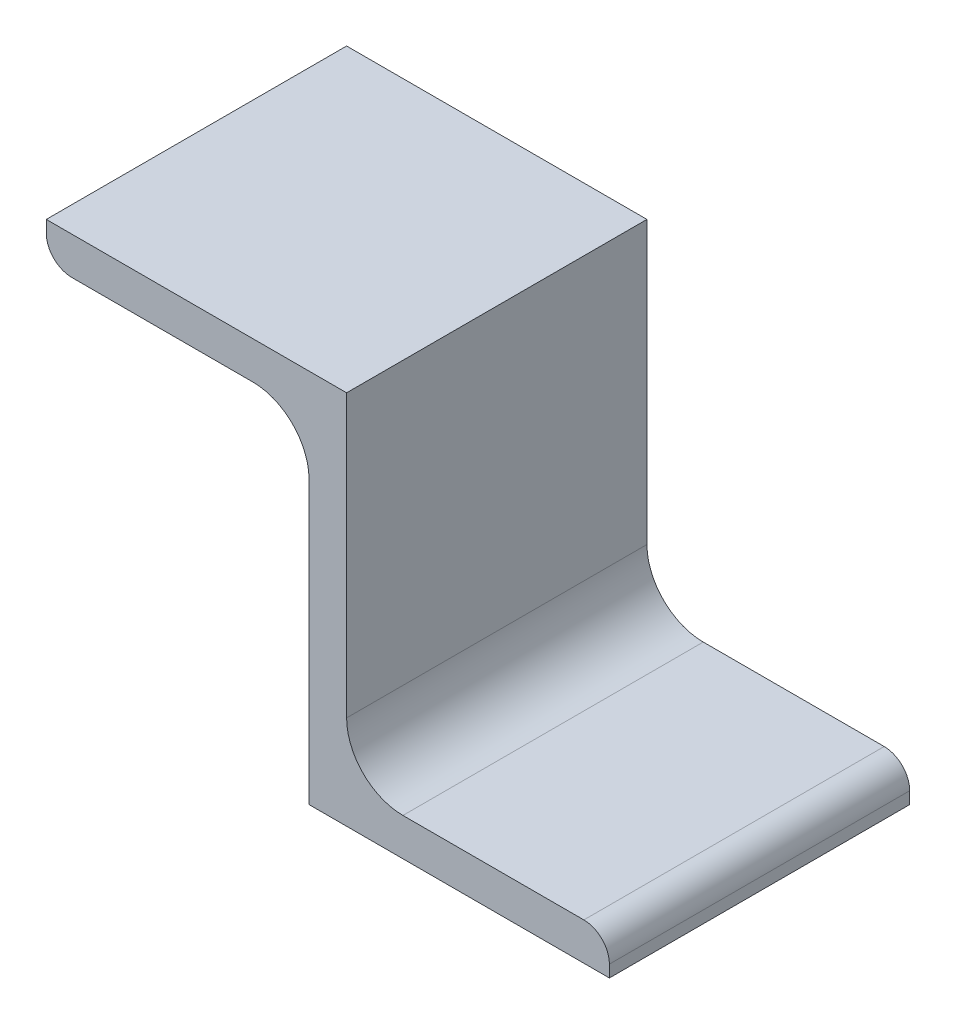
from build123d import *

# Parameters (mm, degrees)
BASE_ZEE_DEPTH = 12.7


with BuildPart() as part:
    # Sketch1 → Base-Zee (new, symmetric)
    with BuildSketch(Plane.XY):
        with BuildLine():
            Line((0, 0), (0, 23.8125))
            ThreePointArc((0, 23.8125), (-1.394903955, 27.180096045), (-4.7625, 28.575))
            Line((-4.7625, 28.575), (-20.066, 28.575))
            ThreePointArc((-20.066, 28.575), (-21.592643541, 29.207356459), (-22.225, 30.734))
            Line((-22.225, 30.734), (-22.225, 31.75))
            Line((-22.225, 31.75), (3.175, 31.75))
            Line((3.175, 31.75), (3.175, 7.9375))
            ThreePointArc((3.175, 7.9375), (4.569903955, 4.569903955), (7.9375, 3.175))
            Line((7.9375, 3.175), (23.241, 3.175))
            ThreePointArc((23.241, 3.175), (24.767643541, 2.542643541), (25.4, 1.016))
            Line((25.4, 1.016), (25.4, 0))
            Line((25.4, 0), (0, 0))
        make_face()
    extrude(amount=BASE_ZEE_DEPTH, both=True)


solid = part.part
